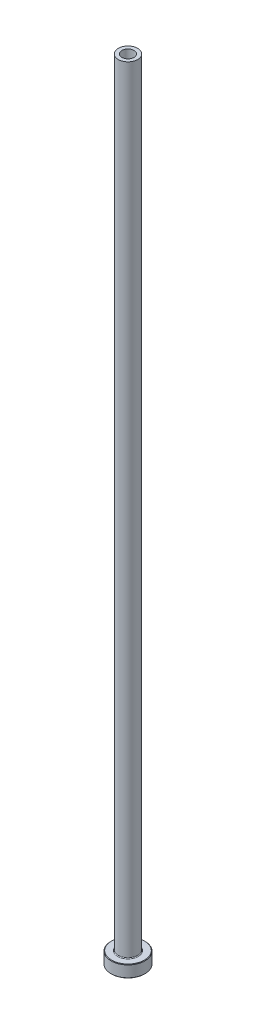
from build123d import *

# Parameters (mm, degrees)
FILLET1_R     = 0.3
CHAMFER1_SIZE = 0.2
CHAMFER3_SIZE = 0.5


with BuildPart() as part:
    # Sketch1 → Revolve1 (revolve)
    with BuildSketch(Plane.XY, mode=Mode.PRIVATE) as revolve1_sk:
        Polygon((-2.5, 325), (-4, 325), (-4, 5), (-7, 5), (-7, 0), (-2.75, 0), (-2.75, 268), (-2.5, 280), align=None)
    revolve(revolve1_sk.sketch.rotate(Axis((0, 92.187680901, 0), (0, -1, 0)), 270), axis=Axis((0, 92.187680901, 0), (0, -1, 0)))

    # Fillet1
    fillet1_edges = [part.edges().sort_by_distance(p)[0] for p in [
        (0, 5, -4),
    ]]
    fillet(fillet1_edges, radius=FILLET1_R)

    # Chamfer1
    chamfer1_edges = [part.edges().sort_by_distance(p)[0] for p in [
        (0, 0, -7),
        (0, 5, -7),
    ]]
    chamfer(chamfer1_edges, length=CHAMFER1_SIZE)

    # Chamfer3
    chamfer3_edges = [part.edges().sort_by_distance(p)[0] for p in [
        (0, 0, -2.75),
    ]]
    chamfer(chamfer3_edges, length=CHAMFER3_SIZE)


solid = part.part
